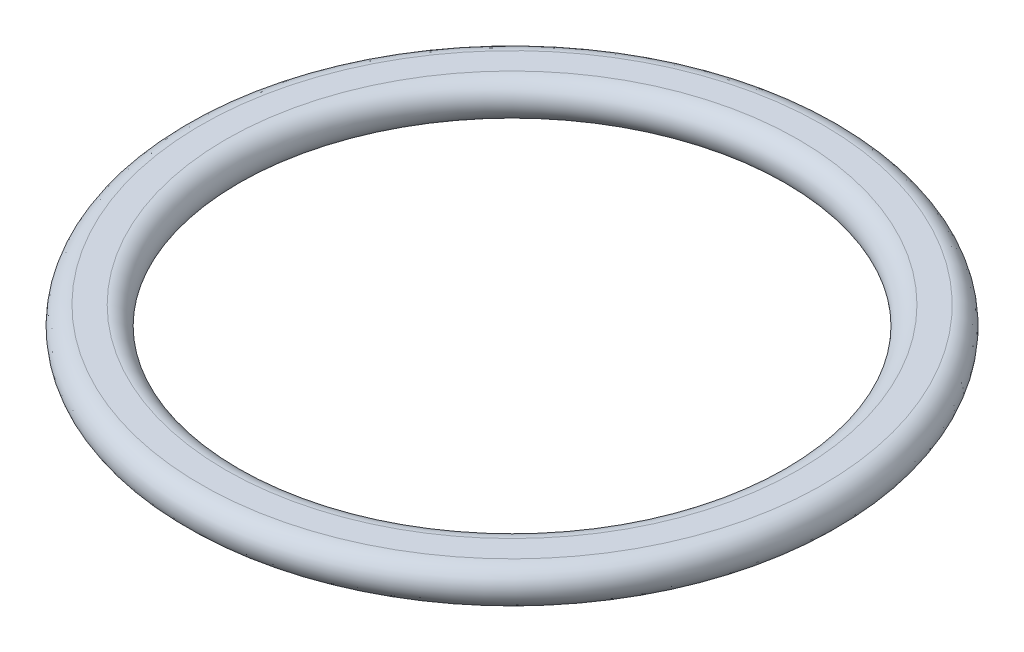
ISO-10303-21;
HEADER;
FILE_DESCRIPTION(('STEP AP214'),'2;1');
FILE_NAME('part.step','',(''),(''),'','','');
FILE_SCHEMA(('AUTOMOTIVE_DESIGN { 1 0 10303 214 1 1 1 1 }'));
ENDSEC;
DATA;
#1=APPLICATION_CONTEXT('core data for automotive mechanical design processes');
#2=APPLICATION_PROTOCOL_DEFINITION('international standard','automotive_design',2000,#1);
#3=PRODUCT_CONTEXT('',#1,'mechanical');
#4=PRODUCT('Part','Part','',(#3));
#5=PRODUCT_RELATED_PRODUCT_CATEGORY('part','',(#4));
#6=PRODUCT_DEFINITION_FORMATION('','',#4);
#7=PRODUCT_DEFINITION_CONTEXT('part definition',#1,'design');
#8=PRODUCT_DEFINITION('design','',#6,#7);
#9=PRODUCT_DEFINITION_SHAPE('','',#8);
#10=(LENGTH_UNIT() NAMED_UNIT(*) SI_UNIT(.MILLI.,.METRE.));
#11=(NAMED_UNIT(*) PLANE_ANGLE_UNIT() SI_UNIT($,.RADIAN.));
#12=(NAMED_UNIT(*) SI_UNIT($,.STERADIAN.) SOLID_ANGLE_UNIT());
#13=UNCERTAINTY_MEASURE_WITH_UNIT(LENGTH_MEASURE(1.E-05),#10,'distance_accuracy_value','');
#14=(GEOMETRIC_REPRESENTATION_CONTEXT(3) GLOBAL_UNCERTAINTY_ASSIGNED_CONTEXT((#13)) GLOBAL_UNIT_ASSIGNED_CONTEXT((#10,
#11,#12)) REPRESENTATION_CONTEXT('',''));
#15=CARTESIAN_POINT('',(0.,0.,0.));
#16=DIRECTION('',(0.,0.,1.));
#17=DIRECTION('',(1.,0.,0.));
#18=AXIS2_PLACEMENT_3D('',#15,#16,#17);
#19=CARTESIAN_POINT('',(0.,0.,0.));
#20=DIRECTION('',(0.,-1.,0.));
#21=DIRECTION('',(0.,0.,-1.));
#22=AXIS2_PLACEMENT_3D('',#19,#20,#21);
#23=TOROIDAL_SURFACE('',#22,29.65,1.9);
#24=CARTESIAN_POINT('',(0.,-1.9,0.));
#25=DIRECTION('',(0.,-1.,0.));
#26=DIRECTION('',(0.,0.,-1.));
#27=AXIS2_PLACEMENT_3D('',#24,#25,#26);
#28=CIRCLE('',#27,29.65);
#29=CARTESIAN_POINT('',(0.,-1.9,-29.65));
#30=VERTEX_POINT('',#29);
#31=EDGE_CURVE('E10',#30,#30,#28,.T.);
#32=ORIENTED_EDGE('',*,*,#31,.T.);
#33=EDGE_LOOP('',(#32));
#34=FACE_BOUND('',#33,.T.);
#35=CARTESIAN_POINT('',(0.,1.9,0.));
#36=DIRECTION('',(0.,-1.,0.));
#37=DIRECTION('',(0.,0.,-1.));
#38=AXIS2_PLACEMENT_3D('',#35,#36,#37);
#39=CIRCLE('',#38,29.65);
#40=CARTESIAN_POINT('',(0.,1.9,-29.65));
#41=VERTEX_POINT('',#40);
#42=EDGE_CURVE('E45',#41,#41,#39,.T.);
#43=ORIENTED_EDGE('',*,*,#42,.F.);
#44=EDGE_LOOP('',(#43));
#45=FACE_BOUND('',#44,.T.);
#46=ADVANCED_FACE('F31',(#34,#45),#23,.T.);
#47=CARTESIAN_POINT('',(29.65,-1.9,0.));
#48=DIRECTION('',(0.,-1.,0.));
#49=DIRECTION('',(0.,0.,-1.));
#50=AXIS2_PLACEMENT_3D('',#47,#48,#49);
#51=PLANE('',#50);
#52=CARTESIAN_POINT('',(0.,-1.9,0.));
#53=DIRECTION('',(0.,-1.,0.));
#54=DIRECTION('',(0.,0.,-1.));
#55=AXIS2_PLACEMENT_3D('',#52,#53,#54);
#56=CIRCLE('',#55,32.23);
#57=CARTESIAN_POINT('',(0.,-1.9,-32.23));
#58=VERTEX_POINT('',#57);
#59=EDGE_CURVE('E37',#58,#58,#56,.T.);
#60=ORIENTED_EDGE('',*,*,#59,.T.);
#61=EDGE_LOOP('',(#60));
#62=FACE_BOUND('',#61,.T.);
#63=ORIENTED_EDGE('',*,*,#31,.F.);
#64=EDGE_LOOP('',(#63));
#65=FACE_BOUND('',#64,.T.);
#66=ADVANCED_FACE('F61',(#62,#65),#51,.T.);
#67=CARTESIAN_POINT('',(32.23,-1.9,0.));
#68=CARTESIAN_POINT('',(32.296641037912,-1.9,0.));
#69=CARTESIAN_POINT('',(32.3633741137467,-1.89648421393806,0.));
#70=CARTESIAN_POINT('',(32.429646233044,-1.88948177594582,0.));
#71=CARTESIAN_POINT('',(32.64112419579,-1.86713661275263,0.));
#72=CARTESIAN_POINT('',(32.8516606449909,-1.80797131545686,0.));
#73=CARTESIAN_POINT('',(33.0438209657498,-1.71688538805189,0.));
#74=CARTESIAN_POINT('',(33.2359812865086,-1.62579946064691,0.));
#75=CARTESIAN_POINT('',(33.4150654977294,-1.50028064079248,0.));
#76=CARTESIAN_POINT('',(33.5662435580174,-1.35072319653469,0.));
#77=CARTESIAN_POINT('',(33.7174216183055,-1.2011657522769,0.));
#78=CARTESIAN_POINT('',(33.8448632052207,-1.02344470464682,0.));
#79=CARTESIAN_POINT('',(33.9380148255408,-0.832277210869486,0.));
#80=CARTESIAN_POINT('',(34.0311664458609,-0.641109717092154,0.));
#81=CARTESIAN_POINT('',(34.0925973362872,-0.431223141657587,0.));
#82=CARTESIAN_POINT('',(34.1172203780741,-0.219998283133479,0.));
#83=CARTESIAN_POINT('',(34.141843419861,-0.00877342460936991,0.));
#84=CARTESIAN_POINT('',(34.1303377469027,0.209615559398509,0.));
#85=CARTESIAN_POINT('',(34.0836561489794,0.417083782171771,0.));
#86=CARTESIAN_POINT('',(34.0369745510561,0.624552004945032,0.));
#87=CARTESIAN_POINT('',(33.95382949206,0.826821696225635,0.));
#88=CARTESIAN_POINT('',(33.841106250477,1.0071428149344,0.));
#89=CARTESIAN_POINT('',(33.7283830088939,1.18746393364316,0.));
#90=CARTESIAN_POINT('',(33.5829725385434,1.35080995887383,0.));
#91=CARTESIAN_POINT('',(33.4169163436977,1.48365413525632,0.));
#92=CARTESIAN_POINT('',(33.2508601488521,1.61649831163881,0.));
#93=CARTESIAN_POINT('',(33.0595781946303,1.72250464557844,0.));
#94=CARTESIAN_POINT('',(32.8589106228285,1.79289470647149,0.));
#95=CARTESIAN_POINT('',(32.6582430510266,1.86328476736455,0.));
#96=CARTESIAN_POINT('',(32.4426552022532,1.9,0.));
#97=CARTESIAN_POINT('',(32.23,1.9,0.));
#98=B_SPLINE_CURVE_WITH_KNOTS('',3,(#67,#68,#69,#70,#71,#72,#73,#74,#75,#76,#77,#78,#79,#80,#81,
#82,#83,#84,#85,#86,#87,#88,#89,#90,#91,#92,#93,#94,#95,#96,#97),.UNSPECIFIED.,.F.,.F.,(4,3,3,3,
3,3,3,3,3,3,4),(0.,0.000197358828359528,0.000835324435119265,0.001473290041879,
0.00211125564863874,0.00274922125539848,0.00338718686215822,0.00402515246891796,
0.0046631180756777,0.00530108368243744,0.00593904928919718),.UNSPECIFIED.);
#99=CARTESIAN_POINT('',(0.,2.00713029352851,0.));
#100=DIRECTION('',(0.,-1.,0.));
#101=AXIS1_PLACEMENT('',#99,#100);
#102=SURFACE_OF_REVOLUTION('',#98,#101);
#103=CARTESIAN_POINT('',(0.,1.9,0.));
#104=DIRECTION('',(0.,-1.,0.));
#105=DIRECTION('',(0.,0.,-1.));
#106=AXIS2_PLACEMENT_3D('',#103,#104,#105);
#107=CIRCLE('',#106,32.23);
#108=CARTESIAN_POINT('',(0.,1.9,-32.23));
#109=VERTEX_POINT('',#108);
#110=EDGE_CURVE('E41',#109,#109,#107,.T.);
#111=ORIENTED_EDGE('',*,*,#110,.T.);
#112=EDGE_LOOP('',(#111));
#113=FACE_BOUND('',#112,.T.);
#114=ORIENTED_EDGE('',*,*,#59,.F.);
#115=EDGE_LOOP('',(#114));
#116=FACE_BOUND('',#115,.T.);
#117=ADVANCED_FACE('F57',(#113,#116),#102,.F.);
#118=CARTESIAN_POINT('',(32.23,1.9,0.));
#119=DIRECTION('',(0.,1.,0.));
#120=DIRECTION('',(0.,0.,1.));
#121=AXIS2_PLACEMENT_3D('',#118,#119,#120);
#122=PLANE('',#121);
#123=ORIENTED_EDGE('',*,*,#42,.T.);
#124=EDGE_LOOP('',(#123));
#125=FACE_BOUND('',#124,.T.);
#126=ORIENTED_EDGE('',*,*,#110,.F.);
#127=EDGE_LOOP('',(#126));
#128=FACE_BOUND('',#127,.T.);
#129=ADVANCED_FACE('F60',(#125,#128),#122,.T.);
#130=CLOSED_SHELL('',(#46,#66,#117,#129));
#131=MANIFOLD_SOLID_BREP('B2',#130);
#132=ADVANCED_BREP_SHAPE_REPRESENTATION('',(#18,#131),#14);
#133=SHAPE_DEFINITION_REPRESENTATION(#9,#132);
ENDSEC;
END-ISO-10303-21;
